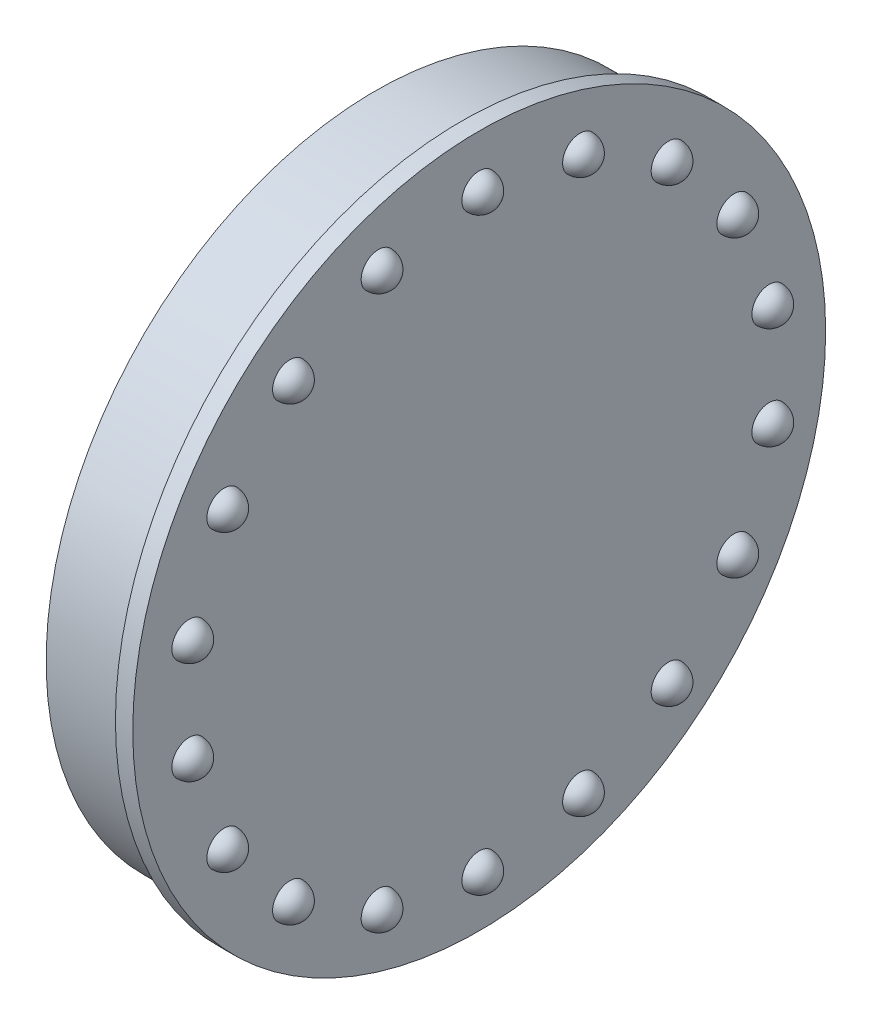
ISO-10303-21;
HEADER;
FILE_DESCRIPTION(('STEP AP214'),'2;1');
FILE_NAME('part.step','',(''),(''),'','','');
FILE_SCHEMA(('AUTOMOTIVE_DESIGN { 1 0 10303 214 1 1 1 1 }'));
ENDSEC;
DATA;
#1=APPLICATION_CONTEXT('core data for automotive mechanical design processes');
#2=APPLICATION_PROTOCOL_DEFINITION('international standard','automotive_design',2000,#1);
#3=PRODUCT_CONTEXT('',#1,'mechanical');
#4=PRODUCT('Part','Part','',(#3));
#5=PRODUCT_RELATED_PRODUCT_CATEGORY('part','',(#4));
#6=PRODUCT_DEFINITION_FORMATION('','',#4);
#7=PRODUCT_DEFINITION_CONTEXT('part definition',#1,'design');
#8=PRODUCT_DEFINITION('design','',#6,#7);
#9=PRODUCT_DEFINITION_SHAPE('','',#8);
#10=(LENGTH_UNIT() NAMED_UNIT(*) SI_UNIT(.MILLI.,.METRE.));
#11=(NAMED_UNIT(*) PLANE_ANGLE_UNIT() SI_UNIT($,.RADIAN.));
#12=(NAMED_UNIT(*) SI_UNIT($,.STERADIAN.) SOLID_ANGLE_UNIT());
#13=UNCERTAINTY_MEASURE_WITH_UNIT(LENGTH_MEASURE(1.E-05),#10,'distance_accuracy_value','');
#14=(GEOMETRIC_REPRESENTATION_CONTEXT(3) GLOBAL_UNCERTAINTY_ASSIGNED_CONTEXT((#13)) GLOBAL_UNIT_ASSIGNED_CONTEXT((#10,
#11,#12)) REPRESENTATION_CONTEXT('',''));
#15=CARTESIAN_POINT('',(0.,0.,0.));
#16=DIRECTION('',(0.,0.,1.));
#17=DIRECTION('',(1.,0.,0.));
#18=AXIS2_PLACEMENT_3D('',#15,#16,#17);
#19=CARTESIAN_POINT('',(6.,0.,0.));
#20=DIRECTION('',(1.,0.,0.));
#21=DIRECTION('',(0.,0.,-1.));
#22=AXIS2_PLACEMENT_3D('',#19,#20,#21);
#23=PLANE('',#22);
#24=CARTESIAN_POINT('',(6.,-13.0227555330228,-10.927389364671));
#25=DIRECTION('',(1.,0.,0.));
#26=DIRECTION('',(0.,0.,-1.));
#27=AXIS2_PLACEMENT_3D('',#24,#25,#26);
#28=CIRCLE('',#27,1.);
#29=CARTESIAN_POINT('',(6.,-13.0227555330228,-11.927389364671));
#30=VERTEX_POINT('',#29);
#31=EDGE_CURVE('E98',#30,#30,#28,.T.);
#32=ORIENTED_EDGE('',*,*,#31,.F.);
#33=EDGE_LOOP('',(#32));
#34=FACE_BOUND('',#33,.T.);
#35=CARTESIAN_POINT('',(6.,-2.95201902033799,-16.7417318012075));
#36=DIRECTION('',(1.,0.,0.));
#37=DIRECTION('',(0.,0.,-1.));
#38=AXIS2_PLACEMENT_3D('',#35,#36,#37);
#39=CIRCLE('',#38,1.);
#40=CARTESIAN_POINT('',(6.,-2.95201902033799,-17.7417318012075));
#41=VERTEX_POINT('',#40);
#42=EDGE_CURVE('E92',#41,#41,#39,.T.);
#43=ORIENTED_EDGE('',*,*,#42,.F.);
#44=EDGE_LOOP('',(#43));
#45=FACE_BOUND('',#44,.T.);
#46=CARTESIAN_POINT('',(6.,8.49999999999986,-14.7224318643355));
#47=DIRECTION('',(1.,0.,0.));
#48=DIRECTION('',(0.,0.,-1.));
#49=AXIS2_PLACEMENT_3D('',#46,#47,#48);
#50=CIRCLE('',#49,0.999999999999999);
#51=CARTESIAN_POINT('',(6.,8.49999999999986,-15.7224318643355));
#52=VERTEX_POINT('',#51);
#53=EDGE_CURVE('E86',#52,#52,#50,.T.);
#54=ORIENTED_EDGE('',*,*,#53,.F.);
#55=EDGE_LOOP('',(#54));
#56=FACE_BOUND('',#55,.T.);
#57=CARTESIAN_POINT('',(6.,15.9747745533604,-5.81434243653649));
#58=DIRECTION('',(1.,0.,0.));
#59=DIRECTION('',(0.,0.,-1.));
#60=AXIS2_PLACEMENT_3D('',#57,#58,#59);
#61=CIRCLE('',#60,1.);
#62=CARTESIAN_POINT('',(6.,15.9747745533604,-6.81434243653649));
#63=VERTEX_POINT('',#62);
#64=EDGE_CURVE('E80',#63,#63,#61,.T.);
#65=ORIENTED_EDGE('',*,*,#64,.F.);
#66=EDGE_LOOP('',(#65));
#67=FACE_BOUND('',#66,.T.);
#68=CARTESIAN_POINT('',(6.,15.9747745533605,5.81434243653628));
#69=DIRECTION('',(1.,0.,0.));
#70=DIRECTION('',(0.,0.,-1.));
#71=AXIS2_PLACEMENT_3D('',#68,#69,#70);
#72=CIRCLE('',#71,1.);
#73=CARTESIAN_POINT('',(6.,15.9747745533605,4.81434243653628));
#74=VERTEX_POINT('',#73);
#75=EDGE_CURVE('E74',#74,#74,#72,.T.);
#76=ORIENTED_EDGE('',*,*,#75,.F.);
#77=EDGE_LOOP('',(#76));
#78=FACE_BOUND('',#77,.T.);
#79=CARTESIAN_POINT('',(6.,8.50000000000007,14.7224318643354));
#80=DIRECTION('',(1.,0.,0.));
#81=DIRECTION('',(0.,0.,-1.));
#82=AXIS2_PLACEMENT_3D('',#79,#80,#81);
#83=CIRCLE('',#82,0.999999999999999);
#84=CARTESIAN_POINT('',(6.,8.50000000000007,13.7224318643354));
#85=VERTEX_POINT('',#84);
#86=EDGE_CURVE('E68',#85,#85,#83,.T.);
#87=ORIENTED_EDGE('',*,*,#86,.F.);
#88=EDGE_LOOP('',(#87));
#89=FACE_BOUND('',#88,.T.);
#90=CARTESIAN_POINT('',(6.,-2.95201902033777,16.7417318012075));
#91=DIRECTION('',(1.,0.,0.));
#92=DIRECTION('',(0.,0.,-1.));
#93=AXIS2_PLACEMENT_3D('',#90,#91,#92);
#94=CIRCLE('',#93,0.999999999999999);
#95=CARTESIAN_POINT('',(6.,-2.95201902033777,15.7417318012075));
#96=VERTEX_POINT('',#95);
#97=EDGE_CURVE('E62',#96,#96,#94,.T.);
#98=ORIENTED_EDGE('',*,*,#97,.F.);
#99=EDGE_LOOP('',(#98));
#100=FACE_BOUND('',#99,.T.);
#101=CARTESIAN_POINT('',(6.,-13.0227555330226,10.9273893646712));
#102=DIRECTION('',(1.,0.,0.));
#103=DIRECTION('',(0.,0.,-1.));
#104=AXIS2_PLACEMENT_3D('',#101,#102,#103);
#105=CIRCLE('',#104,0.999999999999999);
#106=CARTESIAN_POINT('',(6.,-13.0227555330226,9.92738936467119));
#107=VERTEX_POINT('',#106);
#108=EDGE_CURVE('E56',#107,#107,#105,.T.);
#109=ORIENTED_EDGE('',*,*,#108,.F.);
#110=EDGE_LOOP('',(#109));
#111=FACE_BOUND('',#110,.T.);
#112=CARTESIAN_POINT('',(6.,-17.,0.));
#113=DIRECTION('',(1.,0.,0.));
#114=DIRECTION('',(0.,0.,-1.));
#115=AXIS2_PLACEMENT_3D('',#112,#113,#114);
#116=CIRCLE('',#115,1.);
#117=CARTESIAN_POINT('',(6.,-17.,-1.));
#118=VERTEX_POINT('',#117);
#119=EDGE_CURVE('E50',#118,#118,#116,.T.);
#120=ORIENTED_EDGE('',*,*,#119,.F.);
#121=EDGE_LOOP('',(#120));
#122=FACE_BOUND('',#121,.T.);
#123=CARTESIAN_POINT('',(6.,0.,0.));
#124=DIRECTION('',(1.,0.,0.));
#125=DIRECTION('',(0.,0.,-1.));
#126=AXIS2_PLACEMENT_3D('',#123,#124,#125);
#127=CIRCLE('',#126,20.);
#128=CARTESIAN_POINT('',(6.,0.,-20.));
#129=VERTEX_POINT('',#128);
#130=EDGE_CURVE('E41',#129,#129,#127,.T.);
#131=ORIENTED_EDGE('',*,*,#130,.T.);
#132=EDGE_LOOP('',(#131));
#133=FACE_BOUND('',#132,.T.);
#134=CARTESIAN_POINT('',(6.,-15.9747745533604,5.81434243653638));
#135=DIRECTION('',(1.,0.,0.));
#136=DIRECTION('',(0.,0.,-1.));
#137=AXIS2_PLACEMENT_3D('',#134,#135,#136);
#138=CIRCLE('',#137,1.);
#139=CARTESIAN_POINT('',(6.,-15.9747745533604,4.81434243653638));
#140=VERTEX_POINT('',#139);
#141=EDGE_CURVE('E53',#140,#140,#138,.T.);
#142=ORIENTED_EDGE('',*,*,#141,.F.);
#143=EDGE_LOOP('',(#142));
#144=FACE_BOUND('',#143,.T.);
#145=CARTESIAN_POINT('',(6.,-8.49999999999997,14.7224318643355));
#146=DIRECTION('',(1.,0.,0.));
#147=DIRECTION('',(0.,0.,-1.));
#148=AXIS2_PLACEMENT_3D('',#145,#146,#147);
#149=CIRCLE('',#148,1.);
#150=CARTESIAN_POINT('',(6.,-8.49999999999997,13.7224318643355));
#151=VERTEX_POINT('',#150);
#152=EDGE_CURVE('E59',#151,#151,#149,.T.);
#153=ORIENTED_EDGE('',*,*,#152,.F.);
#154=EDGE_LOOP('',(#153));
#155=FACE_BOUND('',#154,.T.);
#156=CARTESIAN_POINT('',(6.,2.95201902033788,16.7417318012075));
#157=DIRECTION('',(1.,0.,0.));
#158=DIRECTION('',(0.,0.,-1.));
#159=AXIS2_PLACEMENT_3D('',#156,#157,#158);
#160=CIRCLE('',#159,1.);
#161=CARTESIAN_POINT('',(6.,2.95201902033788,15.7417318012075));
#162=VERTEX_POINT('',#161);
#163=EDGE_CURVE('E65',#162,#162,#160,.T.);
#164=ORIENTED_EDGE('',*,*,#163,.F.);
#165=EDGE_LOOP('',(#164));
#166=FACE_BOUND('',#165,.T.);
#167=CARTESIAN_POINT('',(6.,13.0227555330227,10.9273893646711));
#168=DIRECTION('',(1.,0.,0.));
#169=DIRECTION('',(0.,0.,-1.));
#170=AXIS2_PLACEMENT_3D('',#167,#168,#169);
#171=CIRCLE('',#170,1.);
#172=CARTESIAN_POINT('',(6.,13.0227555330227,9.9273893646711));
#173=VERTEX_POINT('',#172);
#174=EDGE_CURVE('E71',#173,#173,#171,.T.);
#175=ORIENTED_EDGE('',*,*,#174,.F.);
#176=EDGE_LOOP('',(#175));
#177=FACE_BOUND('',#176,.T.);
#178=CARTESIAN_POINT('',(6.,17.,-1.18710434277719E-13));
#179=DIRECTION('',(1.,0.,0.));
#180=DIRECTION('',(0.,0.,-1.));
#181=AXIS2_PLACEMENT_3D('',#178,#179,#180);
#182=CIRCLE('',#181,1.);
#183=CARTESIAN_POINT('',(6.,17.,-1.00000000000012));
#184=VERTEX_POINT('',#183);
#185=EDGE_CURVE('E77',#184,#184,#182,.T.);
#186=ORIENTED_EDGE('',*,*,#185,.F.);
#187=EDGE_LOOP('',(#186));
#188=FACE_BOUND('',#187,.T.);
#189=CARTESIAN_POINT('',(6.,13.0227555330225,-10.9273893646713));
#190=DIRECTION('',(1.,0.,0.));
#191=DIRECTION('',(0.,0.,-1.));
#192=AXIS2_PLACEMENT_3D('',#189,#190,#191);
#193=CIRCLE('',#192,1.);
#194=CARTESIAN_POINT('',(6.,13.0227555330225,-11.9273893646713));
#195=VERTEX_POINT('',#194);
#196=EDGE_CURVE('E83',#195,#195,#193,.T.);
#197=ORIENTED_EDGE('',*,*,#196,.F.);
#198=EDGE_LOOP('',(#197));
#199=FACE_BOUND('',#198,.T.);
#200=CARTESIAN_POINT('',(6.,2.95201902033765,-16.7417318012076));
#201=DIRECTION('',(1.,0.,0.));
#202=DIRECTION('',(0.,0.,-1.));
#203=AXIS2_PLACEMENT_3D('',#200,#201,#202);
#204=CIRCLE('',#203,1.);
#205=CARTESIAN_POINT('',(6.,2.95201902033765,-17.7417318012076));
#206=VERTEX_POINT('',#205);
#207=EDGE_CURVE('E89',#206,#206,#204,.T.);
#208=ORIENTED_EDGE('',*,*,#207,.F.);
#209=EDGE_LOOP('',(#208));
#210=FACE_BOUND('',#209,.T.);
#211=CARTESIAN_POINT('',(6.,-8.50000000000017,-14.7224318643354));
#212=DIRECTION('',(1.,0.,0.));
#213=DIRECTION('',(0.,0.,-1.));
#214=AXIS2_PLACEMENT_3D('',#211,#212,#213);
#215=CIRCLE('',#214,1.);
#216=CARTESIAN_POINT('',(6.,-8.50000000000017,-15.7224318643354));
#217=VERTEX_POINT('',#216);
#218=EDGE_CURVE('E95',#217,#217,#215,.T.);
#219=ORIENTED_EDGE('',*,*,#218,.F.);
#220=EDGE_LOOP('',(#219));
#221=FACE_BOUND('',#220,.T.);
#222=CARTESIAN_POINT('',(6.,-15.9747745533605,-5.81434243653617));
#223=DIRECTION('',(1.,0.,0.));
#224=DIRECTION('',(0.,0.,-1.));
#225=AXIS2_PLACEMENT_3D('',#222,#223,#224);
#226=CIRCLE('',#225,1.);
#227=CARTESIAN_POINT('',(6.,-15.9747745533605,-6.81434243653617));
#228=VERTEX_POINT('',#227);
#229=EDGE_CURVE('E101',#228,#228,#226,.T.);
#230=ORIENTED_EDGE('',*,*,#229,.F.);
#231=EDGE_LOOP('',(#230));
#232=FACE_BOUND('',#231,.T.);
#233=ADVANCED_FACE('F30',(#34,#45,#56,#67,#78,#89,#100,#111,#122,#133,#144,#155,#166,#177,#188,
#199,#210,#221,#232),#23,.T.);
#234=CARTESIAN_POINT('',(5.,0.,0.));
#235=DIRECTION('',(-1.,0.,0.));
#236=DIRECTION('',(0.,0.,1.));
#237=AXIS2_PLACEMENT_3D('',#234,#235,#236);
#238=CYLINDRICAL_SURFACE('',#237,19.);
#239=CARTESIAN_POINT('',(5.,0.,0.));
#240=DIRECTION('',(1.,0.,0.));
#241=DIRECTION('',(0.,0.,-1.));
#242=AXIS2_PLACEMENT_3D('',#239,#240,#241);
#243=CIRCLE('',#242,19.);
#244=CARTESIAN_POINT('',(5.,0.,-19.));
#245=VERTEX_POINT('',#244);
#246=EDGE_CURVE('E10',#245,#245,#243,.T.);
#247=ORIENTED_EDGE('',*,*,#246,.F.);
#248=EDGE_LOOP('',(#247));
#249=FACE_BOUND('',#248,.T.);
#250=CARTESIAN_POINT('',(0.,0.,0.));
#251=DIRECTION('',(1.,0.,0.));
#252=DIRECTION('',(0.,0.,-1.));
#253=AXIS2_PLACEMENT_3D('',#250,#251,#252);
#254=CIRCLE('',#253,19.);
#255=CARTESIAN_POINT('',(0.,0.,-19.));
#256=VERTEX_POINT('',#255);
#257=EDGE_CURVE('E37',#256,#256,#254,.T.);
#258=ORIENTED_EDGE('',*,*,#257,.T.);
#259=EDGE_LOOP('',(#258));
#260=FACE_BOUND('',#259,.T.);
#261=ADVANCED_FACE('F32',(#249,#260),#238,.T.);
#262=CARTESIAN_POINT('',(0.,0.,0.));
#263=DIRECTION('',(1.,0.,0.));
#264=DIRECTION('',(0.,0.,-1.));
#265=AXIS2_PLACEMENT_3D('',#262,#263,#264);
#266=PLANE('',#265);
#267=ORIENTED_EDGE('',*,*,#257,.F.);
#268=EDGE_LOOP('',(#267));
#269=FACE_BOUND('',#268,.T.);
#270=ADVANCED_FACE('F113',(#269),#266,.F.);
#271=CARTESIAN_POINT('',(5.,0.,0.));
#272=DIRECTION('',(1.,0.,0.));
#273=DIRECTION('',(0.,0.,-1.));
#274=AXIS2_PLACEMENT_3D('',#271,#272,#273);
#275=PLANE('',#274);
#276=CARTESIAN_POINT('',(5.,0.,0.));
#277=DIRECTION('',(1.,0.,0.));
#278=DIRECTION('',(0.,0.,-1.));
#279=AXIS2_PLACEMENT_3D('',#276,#277,#278);
#280=CIRCLE('',#279,20.);
#281=CARTESIAN_POINT('',(5.,0.,-20.));
#282=VERTEX_POINT('',#281);
#283=EDGE_CURVE('E45',#282,#282,#280,.T.);
#284=ORIENTED_EDGE('',*,*,#283,.F.);
#285=EDGE_LOOP('',(#284));
#286=FACE_BOUND('',#285,.T.);
#287=ORIENTED_EDGE('',*,*,#246,.T.);
#288=EDGE_LOOP('',(#287));
#289=FACE_BOUND('',#288,.T.);
#290=ADVANCED_FACE('F119',(#286,#289),#275,.F.);
#291=CARTESIAN_POINT('',(6.,0.,0.));
#292=DIRECTION('',(-1.,0.,0.));
#293=DIRECTION('',(0.,0.,1.));
#294=AXIS2_PLACEMENT_3D('',#291,#292,#293);
#295=CYLINDRICAL_SURFACE('',#294,20.);
#296=ORIENTED_EDGE('',*,*,#130,.F.);
#297=EDGE_LOOP('',(#296));
#298=FACE_BOUND('',#297,.T.);
#299=ORIENTED_EDGE('',*,*,#283,.T.);
#300=EDGE_LOOP('',(#299));
#301=FACE_BOUND('',#300,.T.);
#302=ADVANCED_FACE('F121',(#298,#301),#295,.T.);
#303=CARTESIAN_POINT('',(6.,15.9747745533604,-5.81434243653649));
#304=DIRECTION('',(0.,0.,1.));
#305=DIRECTION('',(1.,0.,0.));
#306=AXIS2_PLACEMENT_3D('',#303,#304,#305);
#307=SPHERICAL_SURFACE('',#306,1.);
#308=CARTESIAN_POINT('',(6.,15.9747745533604,-5.81434243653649));
#309=DIRECTION('',(1.,0.,0.));
#310=DIRECTION('',(0.,0.,-1.));
#311=AXIS2_PLACEMENT_3D('',#308,#309,#310);
#312=SPHERICAL_SURFACE('',#311,1.);
#313=ORIENTED_EDGE('',*,*,#64,.T.);
#314=EDGE_LOOP('',(#313));
#315=FACE_BOUND('',#314,.T.);
#316=ADVANCED_FACE('F123',(#315),#312,.T.);
#317=CARTESIAN_POINT('',(6.,13.0227555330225,-10.9273893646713));
#318=DIRECTION('',(0.,0.,1.));
#319=DIRECTION('',(1.,0.,0.));
#320=AXIS2_PLACEMENT_3D('',#317,#318,#319);
#321=SPHERICAL_SURFACE('',#320,1.);
#322=CARTESIAN_POINT('',(6.,13.0227555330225,-10.9273893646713));
#323=DIRECTION('',(1.,0.,0.));
#324=DIRECTION('',(0.,0.,-1.));
#325=AXIS2_PLACEMENT_3D('',#322,#323,#324);
#326=SPHERICAL_SURFACE('',#325,1.);
#327=ORIENTED_EDGE('',*,*,#196,.T.);
#328=EDGE_LOOP('',(#327));
#329=FACE_BOUND('',#328,.T.);
#330=ADVANCED_FACE('F145',(#329),#326,.T.);
#331=CARTESIAN_POINT('',(6.,8.49999999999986,-14.7224318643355));
#332=DIRECTION('',(0.,0.,1.));
#333=DIRECTION('',(1.,0.,0.));
#334=AXIS2_PLACEMENT_3D('',#331,#332,#333);
#335=SPHERICAL_SURFACE('',#334,1.);
#336=CARTESIAN_POINT('',(6.,8.49999999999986,-14.7224318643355));
#337=DIRECTION('',(1.,0.,0.));
#338=DIRECTION('',(0.,0.,-1.));
#339=AXIS2_PLACEMENT_3D('',#336,#337,#338);
#340=SPHERICAL_SURFACE('',#339,1.);
#341=ORIENTED_EDGE('',*,*,#53,.T.);
#342=EDGE_LOOP('',(#341));
#343=FACE_BOUND('',#342,.T.);
#344=ADVANCED_FACE('F151',(#343),#340,.T.);
#345=CARTESIAN_POINT('',(6.,2.95201902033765,-16.7417318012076));
#346=DIRECTION('',(0.,0.,1.));
#347=DIRECTION('',(1.,0.,0.));
#348=AXIS2_PLACEMENT_3D('',#345,#346,#347);
#349=SPHERICAL_SURFACE('',#348,1.);
#350=CARTESIAN_POINT('',(6.,2.95201902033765,-16.7417318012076));
#351=DIRECTION('',(1.,0.,0.));
#352=DIRECTION('',(0.,0.,-1.));
#353=AXIS2_PLACEMENT_3D('',#350,#351,#352);
#354=SPHERICAL_SURFACE('',#353,1.);
#355=ORIENTED_EDGE('',*,*,#207,.T.);
#356=EDGE_LOOP('',(#355));
#357=FACE_BOUND('',#356,.T.);
#358=ADVANCED_FACE('F158',(#357),#354,.T.);
#359=CARTESIAN_POINT('',(6.,-2.95201902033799,-16.7417318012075));
#360=DIRECTION('',(0.,0.,1.));
#361=DIRECTION('',(1.,0.,0.));
#362=AXIS2_PLACEMENT_3D('',#359,#360,#361);
#363=SPHERICAL_SURFACE('',#362,1.);
#364=CARTESIAN_POINT('',(6.,-2.95201902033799,-16.7417318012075));
#365=DIRECTION('',(1.,0.,0.));
#366=DIRECTION('',(0.,0.,-1.));
#367=AXIS2_PLACEMENT_3D('',#364,#365,#366);
#368=SPHERICAL_SURFACE('',#367,1.);
#369=ORIENTED_EDGE('',*,*,#42,.T.);
#370=EDGE_LOOP('',(#369));
#371=FACE_BOUND('',#370,.T.);
#372=ADVANCED_FACE('F165',(#371),#368,.T.);
#373=CARTESIAN_POINT('',(6.,-8.50000000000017,-14.7224318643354));
#374=DIRECTION('',(0.,0.,1.));
#375=DIRECTION('',(1.,0.,0.));
#376=AXIS2_PLACEMENT_3D('',#373,#374,#375);
#377=SPHERICAL_SURFACE('',#376,1.);
#378=CARTESIAN_POINT('',(6.,-8.50000000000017,-14.7224318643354));
#379=DIRECTION('',(1.,0.,0.));
#380=DIRECTION('',(0.,0.,-1.));
#381=AXIS2_PLACEMENT_3D('',#378,#379,#380);
#382=SPHERICAL_SURFACE('',#381,1.);
#383=ORIENTED_EDGE('',*,*,#218,.T.);
#384=EDGE_LOOP('',(#383));
#385=FACE_BOUND('',#384,.T.);
#386=ADVANCED_FACE('F172',(#385),#382,.T.);
#387=CARTESIAN_POINT('',(6.,-13.0227555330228,-10.927389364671));
#388=DIRECTION('',(0.,0.,1.));
#389=DIRECTION('',(1.,0.,0.));
#390=AXIS2_PLACEMENT_3D('',#387,#388,#389);
#391=SPHERICAL_SURFACE('',#390,1.);
#392=CARTESIAN_POINT('',(6.,-13.0227555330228,-10.927389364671));
#393=DIRECTION('',(1.,0.,0.));
#394=DIRECTION('',(0.,0.,-1.));
#395=AXIS2_PLACEMENT_3D('',#392,#393,#394);
#396=SPHERICAL_SURFACE('',#395,1.);
#397=ORIENTED_EDGE('',*,*,#31,.T.);
#398=EDGE_LOOP('',(#397));
#399=FACE_BOUND('',#398,.T.);
#400=ADVANCED_FACE('F179',(#399),#396,.T.);
#401=CARTESIAN_POINT('',(6.,-15.9747745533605,-5.81434243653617));
#402=DIRECTION('',(0.,0.,1.));
#403=DIRECTION('',(1.,0.,0.));
#404=AXIS2_PLACEMENT_3D('',#401,#402,#403);
#405=SPHERICAL_SURFACE('',#404,1.);
#406=CARTESIAN_POINT('',(6.,-15.9747745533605,-5.81434243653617));
#407=DIRECTION('',(1.,0.,0.));
#408=DIRECTION('',(0.,0.,-1.));
#409=AXIS2_PLACEMENT_3D('',#406,#407,#408);
#410=SPHERICAL_SURFACE('',#409,1.);
#411=ORIENTED_EDGE('',*,*,#229,.T.);
#412=EDGE_LOOP('',(#411));
#413=FACE_BOUND('',#412,.T.);
#414=ADVANCED_FACE('F105',(#413),#410,.T.);
#415=CARTESIAN_POINT('',(6.,-17.,0.));
#416=DIRECTION('',(0.,0.,1.));
#417=DIRECTION('',(1.,0.,0.));
#418=AXIS2_PLACEMENT_3D('',#415,#416,#417);
#419=SPHERICAL_SURFACE('',#418,1.);
#420=CARTESIAN_POINT('',(6.,-17.,0.));
#421=DIRECTION('',(1.,0.,0.));
#422=DIRECTION('',(0.,0.,-1.));
#423=AXIS2_PLACEMENT_3D('',#420,#421,#422);
#424=SPHERICAL_SURFACE('',#423,1.);
#425=ORIENTED_EDGE('',*,*,#119,.T.);
#426=EDGE_LOOP('',(#425));
#427=FACE_BOUND('',#426,.T.);
#428=ADVANCED_FACE('F192',(#427),#424,.T.);
#429=CARTESIAN_POINT('',(6.,-15.9747745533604,5.81434243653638));
#430=DIRECTION('',(0.,0.,1.));
#431=DIRECTION('',(1.,0.,0.));
#432=AXIS2_PLACEMENT_3D('',#429,#430,#431);
#433=SPHERICAL_SURFACE('',#432,1.);
#434=CARTESIAN_POINT('',(6.,-15.9747745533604,5.81434243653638));
#435=DIRECTION('',(1.,0.,0.));
#436=DIRECTION('',(0.,0.,-1.));
#437=AXIS2_PLACEMENT_3D('',#434,#435,#436);
#438=SPHERICAL_SURFACE('',#437,1.);
#439=ORIENTED_EDGE('',*,*,#141,.T.);
#440=EDGE_LOOP('',(#439));
#441=FACE_BOUND('',#440,.T.);
#442=ADVANCED_FACE('F198',(#441),#438,.T.);
#443=CARTESIAN_POINT('',(6.,-13.0227555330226,10.9273893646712));
#444=DIRECTION('',(0.,0.,1.));
#445=DIRECTION('',(1.,0.,0.));
#446=AXIS2_PLACEMENT_3D('',#443,#444,#445);
#447=SPHERICAL_SURFACE('',#446,1.);
#448=CARTESIAN_POINT('',(6.,-13.0227555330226,10.9273893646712));
#449=DIRECTION('',(1.,0.,0.));
#450=DIRECTION('',(0.,0.,-1.));
#451=AXIS2_PLACEMENT_3D('',#448,#449,#450);
#452=SPHERICAL_SURFACE('',#451,1.);
#453=ORIENTED_EDGE('',*,*,#108,.T.);
#454=EDGE_LOOP('',(#453));
#455=FACE_BOUND('',#454,.T.);
#456=ADVANCED_FACE('F205',(#455),#452,.T.);
#457=CARTESIAN_POINT('',(6.,-8.49999999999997,14.7224318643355));
#458=DIRECTION('',(0.,0.,1.));
#459=DIRECTION('',(1.,0.,0.));
#460=AXIS2_PLACEMENT_3D('',#457,#458,#459);
#461=SPHERICAL_SURFACE('',#460,1.);
#462=CARTESIAN_POINT('',(6.,-8.49999999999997,14.7224318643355));
#463=DIRECTION('',(1.,0.,0.));
#464=DIRECTION('',(0.,0.,-1.));
#465=AXIS2_PLACEMENT_3D('',#462,#463,#464);
#466=SPHERICAL_SURFACE('',#465,1.);
#467=ORIENTED_EDGE('',*,*,#152,.T.);
#468=EDGE_LOOP('',(#467));
#469=FACE_BOUND('',#468,.T.);
#470=ADVANCED_FACE('F212',(#469),#466,.T.);
#471=CARTESIAN_POINT('',(6.,-2.95201902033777,16.7417318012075));
#472=DIRECTION('',(0.,0.,1.));
#473=DIRECTION('',(1.,0.,0.));
#474=AXIS2_PLACEMENT_3D('',#471,#472,#473);
#475=SPHERICAL_SURFACE('',#474,1.);
#476=CARTESIAN_POINT('',(6.,-2.95201902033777,16.7417318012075));
#477=DIRECTION('',(1.,0.,0.));
#478=DIRECTION('',(0.,0.,-1.));
#479=AXIS2_PLACEMENT_3D('',#476,#477,#478);
#480=SPHERICAL_SURFACE('',#479,1.);
#481=ORIENTED_EDGE('',*,*,#97,.T.);
#482=EDGE_LOOP('',(#481));
#483=FACE_BOUND('',#482,.T.);
#484=ADVANCED_FACE('F219',(#483),#480,.T.);
#485=CARTESIAN_POINT('',(6.,2.95201902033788,16.7417318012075));
#486=DIRECTION('',(0.,0.,1.));
#487=DIRECTION('',(1.,0.,0.));
#488=AXIS2_PLACEMENT_3D('',#485,#486,#487);
#489=SPHERICAL_SURFACE('',#488,1.);
#490=CARTESIAN_POINT('',(6.,2.95201902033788,16.7417318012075));
#491=DIRECTION('',(1.,0.,0.));
#492=DIRECTION('',(0.,0.,-1.));
#493=AXIS2_PLACEMENT_3D('',#490,#491,#492);
#494=SPHERICAL_SURFACE('',#493,1.);
#495=ORIENTED_EDGE('',*,*,#163,.T.);
#496=EDGE_LOOP('',(#495));
#497=FACE_BOUND('',#496,.T.);
#498=ADVANCED_FACE('F226',(#497),#494,.T.);
#499=CARTESIAN_POINT('',(6.,8.50000000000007,14.7224318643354));
#500=DIRECTION('',(0.,0.,1.));
#501=DIRECTION('',(1.,0.,0.));
#502=AXIS2_PLACEMENT_3D('',#499,#500,#501);
#503=SPHERICAL_SURFACE('',#502,1.);
#504=CARTESIAN_POINT('',(6.,8.50000000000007,14.7224318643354));
#505=DIRECTION('',(1.,0.,0.));
#506=DIRECTION('',(0.,0.,-1.));
#507=AXIS2_PLACEMENT_3D('',#504,#505,#506);
#508=SPHERICAL_SURFACE('',#507,1.);
#509=ORIENTED_EDGE('',*,*,#86,.T.);
#510=EDGE_LOOP('',(#509));
#511=FACE_BOUND('',#510,.T.);
#512=ADVANCED_FACE('F233',(#511),#508,.T.);
#513=CARTESIAN_POINT('',(6.,13.0227555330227,10.9273893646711));
#514=DIRECTION('',(0.,0.,1.));
#515=DIRECTION('',(1.,0.,0.));
#516=AXIS2_PLACEMENT_3D('',#513,#514,#515);
#517=SPHERICAL_SURFACE('',#516,1.);
#518=CARTESIAN_POINT('',(6.,13.0227555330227,10.9273893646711));
#519=DIRECTION('',(1.,0.,0.));
#520=DIRECTION('',(0.,0.,-1.));
#521=AXIS2_PLACEMENT_3D('',#518,#519,#520);
#522=SPHERICAL_SURFACE('',#521,1.);
#523=ORIENTED_EDGE('',*,*,#174,.T.);
#524=EDGE_LOOP('',(#523));
#525=FACE_BOUND('',#524,.T.);
#526=ADVANCED_FACE('F240',(#525),#522,.T.);
#527=CARTESIAN_POINT('',(6.,15.9747745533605,5.81434243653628));
#528=DIRECTION('',(0.,0.,1.));
#529=DIRECTION('',(1.,0.,0.));
#530=AXIS2_PLACEMENT_3D('',#527,#528,#529);
#531=SPHERICAL_SURFACE('',#530,1.);
#532=CARTESIAN_POINT('',(6.,15.9747745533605,5.81434243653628));
#533=DIRECTION('',(1.,0.,0.));
#534=DIRECTION('',(0.,0.,-1.));
#535=AXIS2_PLACEMENT_3D('',#532,#533,#534);
#536=SPHERICAL_SURFACE('',#535,1.);
#537=ORIENTED_EDGE('',*,*,#75,.T.);
#538=EDGE_LOOP('',(#537));
#539=FACE_BOUND('',#538,.T.);
#540=ADVANCED_FACE('F247',(#539),#536,.T.);
#541=CARTESIAN_POINT('',(6.,17.,-1.18710434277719E-13));
#542=DIRECTION('',(0.,0.,1.));
#543=DIRECTION('',(1.,0.,0.));
#544=AXIS2_PLACEMENT_3D('',#541,#542,#543);
#545=SPHERICAL_SURFACE('',#544,1.);
#546=CARTESIAN_POINT('',(6.,17.,-1.18710434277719E-13));
#547=DIRECTION('',(1.,0.,0.));
#548=DIRECTION('',(0.,0.,-1.));
#549=AXIS2_PLACEMENT_3D('',#546,#547,#548);
#550=SPHERICAL_SURFACE('',#549,1.);
#551=ORIENTED_EDGE('',*,*,#185,.T.);
#552=EDGE_LOOP('',(#551));
#553=FACE_BOUND('',#552,.T.);
#554=ADVANCED_FACE('F254',(#553),#550,.T.);
#555=CLOSED_SHELL('',(#233,#261,#270,#290,#302,#316,#330,#344,#358,#372,#386,#400,#414,#428,
#442,#456,#470,#484,#498,#512,#526,#540,#554));
#556=MANIFOLD_SOLID_BREP('B2',#555);
#557=ADVANCED_BREP_SHAPE_REPRESENTATION('',(#18,#556),#14);
#558=SHAPE_DEFINITION_REPRESENTATION(#9,#557);
ENDSEC;
END-ISO-10303-21;
